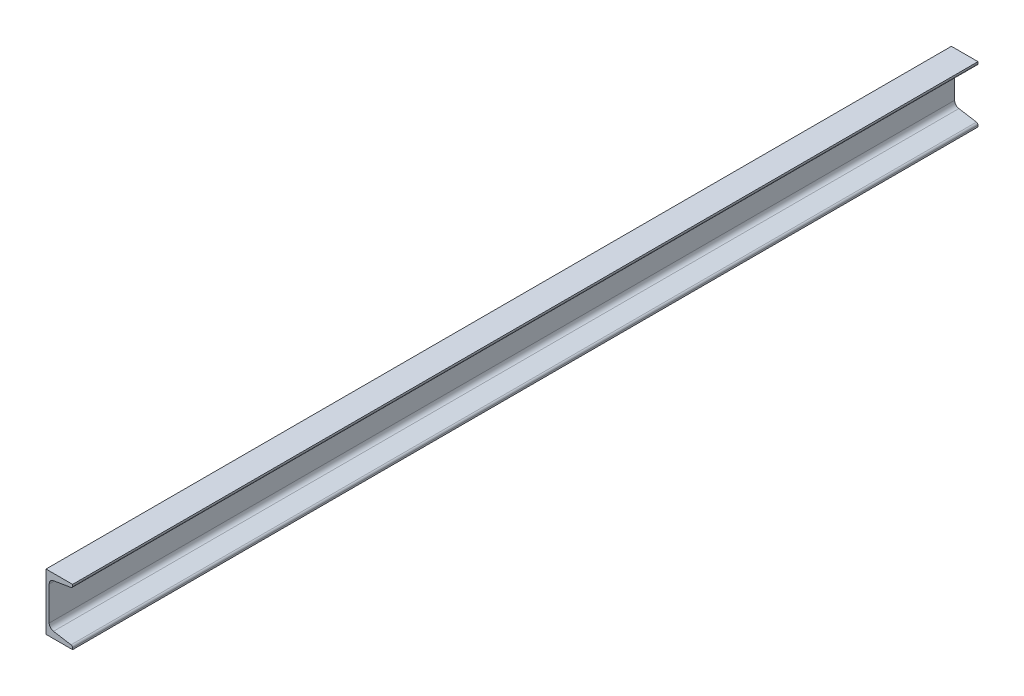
ISO-10303-21;
HEADER;
FILE_DESCRIPTION(('STEP AP214'),'2;1');
FILE_NAME('part.step','',(''),(''),'','','');
FILE_SCHEMA(('AUTOMOTIVE_DESIGN { 1 0 10303 214 1 1 1 1 }'));
ENDSEC;
DATA;
#1=APPLICATION_CONTEXT('core data for automotive mechanical design processes');
#2=APPLICATION_PROTOCOL_DEFINITION('international standard','automotive_design',2000,#1);
#3=PRODUCT_CONTEXT('',#1,'mechanical');
#4=PRODUCT('Part','Part','',(#3));
#5=PRODUCT_RELATED_PRODUCT_CATEGORY('part','',(#4));
#6=PRODUCT_DEFINITION_FORMATION('','',#4);
#7=PRODUCT_DEFINITION_CONTEXT('part definition',#1,'design');
#8=PRODUCT_DEFINITION('design','',#6,#7);
#9=PRODUCT_DEFINITION_SHAPE('','',#8);
#10=(LENGTH_UNIT() NAMED_UNIT(*) SI_UNIT(.MILLI.,.METRE.));
#11=(NAMED_UNIT(*) PLANE_ANGLE_UNIT() SI_UNIT($,.RADIAN.));
#12=(NAMED_UNIT(*) SI_UNIT($,.STERADIAN.) SOLID_ANGLE_UNIT());
#13=UNCERTAINTY_MEASURE_WITH_UNIT(LENGTH_MEASURE(1.E-05),#10,'distance_accuracy_value','');
#14=(GEOMETRIC_REPRESENTATION_CONTEXT(3) GLOBAL_UNCERTAINTY_ASSIGNED_CONTEXT((#13)) GLOBAL_UNIT_ASSIGNED_CONTEXT((#10,
#11,#12)) REPRESENTATION_CONTEXT('',''));
#15=CARTESIAN_POINT('',(0.,0.,0.));
#16=DIRECTION('',(0.,0.,1.));
#17=DIRECTION('',(1.,0.,0.));
#18=AXIS2_PLACEMENT_3D('',#15,#16,#17);
#19=CARTESIAN_POINT('',(0.,0.,609.6));
#20=DIRECTION('',(0.,1.,0.));
#21=DIRECTION('',(-1.,0.,0.));
#22=AXIS2_PLACEMENT_3D('',#19,#20,#21);
#23=PLANE('',#22);
#24=DIRECTION('',(1.,0.,0.));
#25=VECTOR('',#24,1.);
#26=CARTESIAN_POINT('',(0.,0.,-609.6));
#27=LINE('',#26,#25);
#28=CARTESIAN_POINT('',(0.,0.,-609.6));
#29=VERTEX_POINT('',#28);
#30=CARTESIAN_POINT('',(35.814,0.,-609.6));
#31=VERTEX_POINT('',#30);
#32=EDGE_CURVE('E154',#29,#31,#27,.T.);
#33=ORIENTED_EDGE('',*,*,#32,.T.);
#34=DIRECTION('',(0.,0.,-1.));
#35=VECTOR('',#34,1.);
#36=CARTESIAN_POINT('',(35.814,0.,609.6));
#37=LINE('',#36,#35);
#38=CARTESIAN_POINT('',(35.814,0.,609.6));
#39=VERTEX_POINT('',#38);
#40=EDGE_CURVE('E11',#39,#31,#37,.T.);
#41=ORIENTED_EDGE('',*,*,#40,.F.);
#42=DIRECTION('',(1.,0.,0.));
#43=VECTOR('',#42,1.);
#44=CARTESIAN_POINT('',(0.,0.,609.6));
#45=LINE('',#44,#43);
#46=CARTESIAN_POINT('',(0.,0.,609.6));
#47=VERTEX_POINT('',#46);
#48=EDGE_CURVE('E184',#47,#39,#45,.T.);
#49=ORIENTED_EDGE('',*,*,#48,.F.);
#50=DIRECTION('',(0.,0.,-1.));
#51=VECTOR('',#50,1.);
#52=CARTESIAN_POINT('',(0.,0.,609.6));
#53=LINE('',#52,#51);
#54=EDGE_CURVE('E50',#47,#29,#53,.T.);
#55=ORIENTED_EDGE('',*,*,#54,.T.);
#56=EDGE_LOOP('',(#33,#41,#49,#55));
#57=FACE_BOUND('',#56,.T.);
#58=ADVANCED_FACE('F34',(#57),#23,.F.);
#59=CARTESIAN_POINT('',(35.814,0.,609.6));
#60=DIRECTION('',(-1.,0.,0.));
#61=DIRECTION('',(0.,0.,1.));
#62=AXIS2_PLACEMENT_3D('',#59,#60,#61);
#63=PLANE('',#62);
#64=DIRECTION('',(0.,1.,0.));
#65=VECTOR('',#64,1.);
#66=CARTESIAN_POINT('',(35.814,0.,-609.6));
#67=LINE('',#66,#65);
#68=CARTESIAN_POINT('',(35.814,2.15766486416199,-609.6));
#69=VERTEX_POINT('',#68);
#70=EDGE_CURVE('E156',#31,#69,#67,.T.);
#71=ORIENTED_EDGE('',*,*,#70,.T.);
#72=DIRECTION('',(0.,0.,-1.));
#73=VECTOR('',#72,1.);
#74=CARTESIAN_POINT('',(35.814,2.15766486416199,609.6));
#75=LINE('',#74,#73);
#76=CARTESIAN_POINT('',(35.814,2.15766486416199,609.6));
#77=VERTEX_POINT('',#76);
#78=EDGE_CURVE('E42',#77,#69,#75,.T.);
#79=ORIENTED_EDGE('',*,*,#78,.F.);
#80=DIRECTION('',(0.,1.,0.));
#81=VECTOR('',#80,1.);
#82=CARTESIAN_POINT('',(35.814,0.,609.6));
#83=LINE('',#82,#81);
#84=EDGE_CURVE('E100',#39,#77,#83,.T.);
#85=ORIENTED_EDGE('',*,*,#84,.F.);
#86=ORIENTED_EDGE('',*,*,#40,.T.);
#87=EDGE_LOOP('',(#71,#79,#85,#86));
#88=FACE_BOUND('',#87,.T.);
#89=ADVANCED_FACE('F246',(#88),#63,.F.);
#90=CARTESIAN_POINT('',(33.274,2.15766486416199,609.6));
#91=DIRECTION('',(0.,0.,-1.));
#92=DIRECTION('',(-1.,0.,0.));
#93=AXIS2_PLACEMENT_3D('',#90,#91,#92);
#94=CYLINDRICAL_SURFACE('',#93,2.54);
#95=CARTESIAN_POINT('',(33.274,2.15766486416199,-609.6));
#96=DIRECTION('',(0.,0.,1.));
#97=DIRECTION('',(1.,0.,0.));
#98=AXIS2_PLACEMENT_3D('',#95,#96,#97);
#99=CIRCLE('',#98,2.54);
#100=CARTESIAN_POINT('',(33.6916030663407,4.66310049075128,-609.6));
#101=VERTEX_POINT('',#100);
#102=EDGE_CURVE('E158',#69,#101,#99,.T.);
#103=ORIENTED_EDGE('',*,*,#102,.T.);
#104=DIRECTION('',(0.,0.,-1.));
#105=VECTOR('',#104,1.);
#106=CARTESIAN_POINT('',(33.6916030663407,4.66310049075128,609.6));
#107=LINE('',#106,#105);
#108=CARTESIAN_POINT('',(33.6916030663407,4.66310049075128,609.6));
#109=VERTEX_POINT('',#108);
#110=EDGE_CURVE('E199',#109,#101,#107,.T.);
#111=ORIENTED_EDGE('',*,*,#110,.F.);
#112=CARTESIAN_POINT('',(33.274,2.15766486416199,609.6));
#113=DIRECTION('',(0.,0.,1.));
#114=DIRECTION('',(1.,0.,0.));
#115=AXIS2_PLACEMENT_3D('',#112,#113,#114);
#116=CIRCLE('',#115,2.54);
#117=EDGE_CURVE('E206',#77,#109,#116,.T.);
#118=ORIENTED_EDGE('',*,*,#117,.F.);
#119=ORIENTED_EDGE('',*,*,#78,.T.);
#120=EDGE_LOOP('',(#103,#111,#118,#119));
#121=FACE_BOUND('',#120,.T.);
#122=ADVANCED_FACE('F204',(#121),#94,.T.);
#123=CARTESIAN_POINT('',(10.0484717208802,8.60390984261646,609.6));
#124=DIRECTION('',(0.16441065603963,0.986391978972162,0.));
#125=DIRECTION('',(-0.986391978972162,0.16441065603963,0.));
#126=AXIS2_PLACEMENT_3D('',#123,#124,#125);
#127=PLANE('',#126);
#128=DIRECTION('',(0.986391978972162,-0.16441065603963,0.));
#129=VECTOR('',#128,1.);
#130=CARTESIAN_POINT('',(10.0484717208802,8.60390984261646,-609.6));
#131=LINE('',#130,#129);
#132=CARTESIAN_POINT('',(10.0484717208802,8.60390984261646,-609.6));
#133=VERTEX_POINT('',#132);
#134=EDGE_CURVE('E161',#133,#101,#131,.T.);
#135=ORIENTED_EDGE('',*,*,#134,.F.);
#136=DIRECTION('',(0.,0.,-1.));
#137=VECTOR('',#136,1.);
#138=CARTESIAN_POINT('',(10.0484717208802,8.60390984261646,609.6));
#139=LINE('',#138,#137);
#140=CARTESIAN_POINT('',(10.0484717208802,8.60390984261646,609.6));
#141=VERTEX_POINT('',#140);
#142=EDGE_CURVE('E197',#141,#133,#139,.T.);
#143=ORIENTED_EDGE('',*,*,#142,.F.);
#144=DIRECTION('',(0.986391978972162,-0.16441065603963,0.));
#145=VECTOR('',#144,1.);
#146=CARTESIAN_POINT('',(10.0484717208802,8.60390984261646,609.6));
#147=LINE('',#146,#145);
#148=EDGE_CURVE('E215',#141,#109,#147,.T.);
#149=ORIENTED_EDGE('',*,*,#148,.T.);
#150=ORIENTED_EDGE('',*,*,#110,.T.);
#151=EDGE_LOOP('',(#135,#143,#149,#150));
#152=FACE_BOUND('',#151,.T.);
#153=ADVANCED_FACE('F212',(#152),#127,.T.);
#154=CARTESIAN_POINT('',(11.176,15.3685860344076,609.6));
#155=DIRECTION('',(0.,0.,-1.));
#156=DIRECTION('',(-1.,0.,0.));
#157=AXIS2_PLACEMENT_3D('',#154,#155,#156);
#158=CYLINDRICAL_SURFACE('',#157,6.858);
#159=CARTESIAN_POINT('',(11.176,15.3685860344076,-609.6));
#160=DIRECTION('',(0.,0.,1.));
#161=DIRECTION('',(1.,0.,0.));
#162=AXIS2_PLACEMENT_3D('',#159,#160,#161);
#163=CIRCLE('',#162,6.858);
#164=CARTESIAN_POINT('',(4.318,15.3685860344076,-609.6));
#165=VERTEX_POINT('',#164);
#166=EDGE_CURVE('E164',#165,#133,#163,.T.);
#167=ORIENTED_EDGE('',*,*,#166,.F.);
#168=DIRECTION('',(0.,0.,-1.));
#169=VECTOR('',#168,1.);
#170=CARTESIAN_POINT('',(4.318,15.3685860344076,609.6));
#171=LINE('',#170,#169);
#172=CARTESIAN_POINT('',(4.318,15.3685860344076,609.6));
#173=VERTEX_POINT('',#172);
#174=EDGE_CURVE('E195',#173,#165,#171,.T.);
#175=ORIENTED_EDGE('',*,*,#174,.F.);
#176=CARTESIAN_POINT('',(11.176,15.3685860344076,609.6));
#177=DIRECTION('',(0.,0.,1.));
#178=DIRECTION('',(1.,0.,0.));
#179=AXIS2_PLACEMENT_3D('',#176,#177,#178);
#180=CIRCLE('',#179,6.858);
#181=EDGE_CURVE('E218',#173,#141,#180,.T.);
#182=ORIENTED_EDGE('',*,*,#181,.T.);
#183=ORIENTED_EDGE('',*,*,#142,.T.);
#184=EDGE_LOOP('',(#167,#175,#182,#183));
#185=FACE_BOUND('',#184,.T.);
#186=ADVANCED_FACE('F259',(#185),#158,.F.);
#187=CARTESIAN_POINT('',(4.31800000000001,60.8314139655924,609.6));
#188=DIRECTION('',(1.,0.,0.));
#189=DIRECTION('',(0.,1.,0.));
#190=AXIS2_PLACEMENT_3D('',#187,#188,#189);
#191=PLANE('',#190);
#192=DIRECTION('',(0.,-1.,0.));
#193=VECTOR('',#192,1.);
#194=CARTESIAN_POINT('',(4.31800000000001,60.8314139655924,-609.6));
#195=LINE('',#194,#193);
#196=CARTESIAN_POINT('',(4.31800000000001,60.8314139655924,-609.6));
#197=VERTEX_POINT('',#196);
#198=EDGE_CURVE('E167',#197,#165,#195,.T.);
#199=ORIENTED_EDGE('',*,*,#198,.F.);
#200=DIRECTION('',(0.,0.,-1.));
#201=VECTOR('',#200,1.);
#202=CARTESIAN_POINT('',(4.31800000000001,60.8314139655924,609.6));
#203=LINE('',#202,#201);
#204=CARTESIAN_POINT('',(4.31800000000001,60.8314139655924,609.6));
#205=VERTEX_POINT('',#204);
#206=EDGE_CURVE('E193',#205,#197,#203,.T.);
#207=ORIENTED_EDGE('',*,*,#206,.F.);
#208=DIRECTION('',(0.,-1.,0.));
#209=VECTOR('',#208,1.);
#210=CARTESIAN_POINT('',(4.31800000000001,60.8314139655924,609.6));
#211=LINE('',#210,#209);
#212=EDGE_CURVE('E220',#205,#173,#211,.T.);
#213=ORIENTED_EDGE('',*,*,#212,.T.);
#214=ORIENTED_EDGE('',*,*,#174,.T.);
#215=EDGE_LOOP('',(#199,#207,#213,#214));
#216=FACE_BOUND('',#215,.T.);
#217=ADVANCED_FACE('F262',(#216),#191,.T.);
#218=CARTESIAN_POINT('',(11.176,60.8314139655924,609.6));
#219=DIRECTION('',(0.,0.,-1.));
#220=DIRECTION('',(-1.,0.,0.));
#221=AXIS2_PLACEMENT_3D('',#218,#219,#220);
#222=CYLINDRICAL_SURFACE('',#221,6.858);
#223=CARTESIAN_POINT('',(11.176,60.8314139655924,-609.6));
#224=DIRECTION('',(0.,0.,-1.));
#225=DIRECTION('',(-1.,0.,0.));
#226=AXIS2_PLACEMENT_3D('',#223,#224,#225);
#227=CIRCLE('',#226,6.858);
#228=CARTESIAN_POINT('',(10.0484717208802,67.5960901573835,-609.6));
#229=VERTEX_POINT('',#228);
#230=EDGE_CURVE('E170',#197,#229,#227,.T.);
#231=ORIENTED_EDGE('',*,*,#230,.T.);
#232=DIRECTION('',(0.,0.,-1.));
#233=VECTOR('',#232,1.);
#234=CARTESIAN_POINT('',(10.0484717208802,67.5960901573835,609.6));
#235=LINE('',#234,#233);
#236=CARTESIAN_POINT('',(10.0484717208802,67.5960901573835,609.6));
#237=VERTEX_POINT('',#236);
#238=EDGE_CURVE('E190',#237,#229,#235,.T.);
#239=ORIENTED_EDGE('',*,*,#238,.F.);
#240=CARTESIAN_POINT('',(11.176,60.8314139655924,609.6));
#241=DIRECTION('',(0.,0.,-1.));
#242=DIRECTION('',(-1.,0.,0.));
#243=AXIS2_PLACEMENT_3D('',#240,#241,#242);
#244=CIRCLE('',#243,6.858);
#245=EDGE_CURVE('E227',#205,#237,#244,.T.);
#246=ORIENTED_EDGE('',*,*,#245,.F.);
#247=ORIENTED_EDGE('',*,*,#206,.T.);
#248=EDGE_LOOP('',(#231,#239,#246,#247));
#249=FACE_BOUND('',#248,.T.);
#250=ADVANCED_FACE('F266',(#249),#222,.F.);
#251=CARTESIAN_POINT('',(10.0484717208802,67.5960901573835,609.6));
#252=DIRECTION('',(-0.164410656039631,0.986391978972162,0.));
#253=DIRECTION('',(-0.986391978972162,-0.164410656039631,0.));
#254=AXIS2_PLACEMENT_3D('',#251,#252,#253);
#255=PLANE('',#254);
#256=DIRECTION('',(0.986391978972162,0.164410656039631,0.));
#257=VECTOR('',#256,1.);
#258=CARTESIAN_POINT('',(10.0484717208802,67.5960901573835,-609.6));
#259=LINE('',#258,#257);
#260=CARTESIAN_POINT('',(33.6916030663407,71.5368995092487,-609.6));
#261=VERTEX_POINT('',#260);
#262=EDGE_CURVE('E172',#229,#261,#259,.T.);
#263=ORIENTED_EDGE('',*,*,#262,.T.);
#264=DIRECTION('',(0.,0.,-1.));
#265=VECTOR('',#264,1.);
#266=CARTESIAN_POINT('',(33.6916030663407,71.5368995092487,609.6));
#267=LINE('',#266,#265);
#268=CARTESIAN_POINT('',(33.6916030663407,71.5368995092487,609.6));
#269=VERTEX_POINT('',#268);
#270=EDGE_CURVE('E188',#269,#261,#267,.T.);
#271=ORIENTED_EDGE('',*,*,#270,.F.);
#272=DIRECTION('',(0.986391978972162,0.164410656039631,0.));
#273=VECTOR('',#272,1.);
#274=CARTESIAN_POINT('',(10.0484717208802,67.5960901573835,609.6));
#275=LINE('',#274,#273);
#276=EDGE_CURVE('E229',#237,#269,#275,.T.);
#277=ORIENTED_EDGE('',*,*,#276,.F.);
#278=ORIENTED_EDGE('',*,*,#238,.T.);
#279=EDGE_LOOP('',(#263,#271,#277,#278));
#280=FACE_BOUND('',#279,.T.);
#281=ADVANCED_FACE('F270',(#280),#255,.F.);
#282=CARTESIAN_POINT('',(33.274,74.042335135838,609.6));
#283=DIRECTION('',(0.,0.,-1.));
#284=DIRECTION('',(-1.,0.,0.));
#285=AXIS2_PLACEMENT_3D('',#282,#283,#284);
#286=CYLINDRICAL_SURFACE('',#285,2.53999999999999);
#287=CARTESIAN_POINT('',(33.274,74.042335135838,-609.6));
#288=DIRECTION('',(0.,0.,-1.));
#289=DIRECTION('',(-1.,0.,0.));
#290=AXIS2_PLACEMENT_3D('',#287,#288,#289);
#291=CIRCLE('',#290,2.53999999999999);
#292=CARTESIAN_POINT('',(35.814,74.042335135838,-609.6));
#293=VERTEX_POINT('',#292);
#294=EDGE_CURVE('E175',#293,#261,#291,.T.);
#295=ORIENTED_EDGE('',*,*,#294,.F.);
#296=DIRECTION('',(0.,0.,-1.));
#297=VECTOR('',#296,1.);
#298=CARTESIAN_POINT('',(35.814,74.042335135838,609.6));
#299=LINE('',#298,#297);
#300=CARTESIAN_POINT('',(35.814,74.042335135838,609.6));
#301=VERTEX_POINT('',#300);
#302=EDGE_CURVE('E137',#301,#293,#299,.T.);
#303=ORIENTED_EDGE('',*,*,#302,.F.);
#304=CARTESIAN_POINT('',(33.274,74.042335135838,609.6));
#305=DIRECTION('',(0.,0.,-1.));
#306=DIRECTION('',(-1.,0.,0.));
#307=AXIS2_PLACEMENT_3D('',#304,#305,#306);
#308=CIRCLE('',#307,2.53999999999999);
#309=EDGE_CURVE('E146',#301,#269,#308,.T.);
#310=ORIENTED_EDGE('',*,*,#309,.T.);
#311=ORIENTED_EDGE('',*,*,#270,.T.);
#312=EDGE_LOOP('',(#295,#303,#310,#311));
#313=FACE_BOUND('',#312,.T.);
#314=ADVANCED_FACE('F232',(#313),#286,.T.);
#315=CARTESIAN_POINT('',(35.814,76.2,609.6));
#316=DIRECTION('',(1.,0.,0.));
#317=DIRECTION('',(0.,1.,0.));
#318=AXIS2_PLACEMENT_3D('',#315,#316,#317);
#319=PLANE('',#318);
#320=DIRECTION('',(0.,-1.,0.));
#321=VECTOR('',#320,1.);
#322=CARTESIAN_POINT('',(35.814,76.2,-609.6));
#323=LINE('',#322,#321);
#324=CARTESIAN_POINT('',(35.814,76.2,-609.6));
#325=VERTEX_POINT('',#324);
#326=EDGE_CURVE('E133',#325,#293,#323,.T.);
#327=ORIENTED_EDGE('',*,*,#326,.F.);
#328=DIRECTION('',(0.,0.,-1.));
#329=VECTOR('',#328,1.);
#330=CARTESIAN_POINT('',(35.814,76.2,609.6));
#331=LINE('',#330,#329);
#332=CARTESIAN_POINT('',(35.814,76.2,609.6));
#333=VERTEX_POINT('',#332);
#334=EDGE_CURVE('E128',#333,#325,#331,.T.);
#335=ORIENTED_EDGE('',*,*,#334,.F.);
#336=DIRECTION('',(0.,-1.,0.));
#337=VECTOR('',#336,1.);
#338=CARTESIAN_POINT('',(35.814,76.2,609.6));
#339=LINE('',#338,#337);
#340=EDGE_CURVE('E131',#333,#301,#339,.T.);
#341=ORIENTED_EDGE('',*,*,#340,.T.);
#342=ORIENTED_EDGE('',*,*,#302,.T.);
#343=EDGE_LOOP('',(#327,#335,#341,#342));
#344=FACE_BOUND('',#343,.T.);
#345=ADVANCED_FACE('F130',(#344),#319,.T.);
#346=CARTESIAN_POINT('',(0.,76.2,609.6));
#347=DIRECTION('',(0.,1.,0.));
#348=DIRECTION('',(0.,0.,1.));
#349=AXIS2_PLACEMENT_3D('',#346,#347,#348);
#350=PLANE('',#349);
#351=DIRECTION('',(1.,0.,0.));
#352=VECTOR('',#351,1.);
#353=CARTESIAN_POINT('',(0.,76.2,-609.6));
#354=LINE('',#353,#352);
#355=CARTESIAN_POINT('',(0.,76.2,-609.6));
#356=VERTEX_POINT('',#355);
#357=EDGE_CURVE('E179',#356,#325,#354,.T.);
#358=ORIENTED_EDGE('',*,*,#357,.F.);
#359=DIRECTION('',(0.,0.,-1.));
#360=VECTOR('',#359,1.);
#361=CARTESIAN_POINT('',(0.,76.2,609.6));
#362=LINE('',#361,#360);
#363=CARTESIAN_POINT('',(0.,76.2,609.6));
#364=VERTEX_POINT('',#363);
#365=EDGE_CURVE('E88',#364,#356,#362,.T.);
#366=ORIENTED_EDGE('',*,*,#365,.F.);
#367=DIRECTION('',(1.,0.,0.));
#368=VECTOR('',#367,1.);
#369=CARTESIAN_POINT('',(0.,76.2,609.6));
#370=LINE('',#369,#368);
#371=EDGE_CURVE('E144',#364,#333,#370,.T.);
#372=ORIENTED_EDGE('',*,*,#371,.T.);
#373=ORIENTED_EDGE('',*,*,#334,.T.);
#374=EDGE_LOOP('',(#358,#366,#372,#373));
#375=FACE_BOUND('',#374,.T.);
#376=ADVANCED_FACE('F148',(#375),#350,.T.);
#377=CARTESIAN_POINT('',(0.,0.,609.6));
#378=DIRECTION('',(-1.,0.,0.));
#379=DIRECTION('',(0.,-1.,0.));
#380=AXIS2_PLACEMENT_3D('',#377,#378,#379);
#381=PLANE('',#380);
#382=DIRECTION('',(0.,1.,0.));
#383=VECTOR('',#382,1.);
#384=CARTESIAN_POINT('',(0.,0.,-609.6));
#385=LINE('',#384,#383);
#386=EDGE_CURVE('E181',#29,#356,#385,.T.);
#387=ORIENTED_EDGE('',*,*,#386,.F.);
#388=ORIENTED_EDGE('',*,*,#54,.F.);
#389=DIRECTION('',(0.,1.,0.));
#390=VECTOR('',#389,1.);
#391=CARTESIAN_POINT('',(0.,0.,609.6));
#392=LINE('',#391,#390);
#393=EDGE_CURVE('E149',#47,#364,#392,.T.);
#394=ORIENTED_EDGE('',*,*,#393,.T.);
#395=ORIENTED_EDGE('',*,*,#365,.T.);
#396=EDGE_LOOP('',(#387,#388,#394,#395));
#397=FACE_BOUND('',#396,.T.);
#398=ADVANCED_FACE('F235',(#397),#381,.T.);
#399=CARTESIAN_POINT('',(33.274,2.15766486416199,609.6));
#400=DIRECTION('',(0.,0.,1.));
#401=DIRECTION('',(1.,0.,0.));
#402=AXIS2_PLACEMENT_3D('',#399,#400,#401);
#403=PLANE('',#402);
#404=ORIENTED_EDGE('',*,*,#48,.T.);
#405=ORIENTED_EDGE('',*,*,#84,.T.);
#406=ORIENTED_EDGE('',*,*,#117,.T.);
#407=ORIENTED_EDGE('',*,*,#148,.F.);
#408=ORIENTED_EDGE('',*,*,#181,.F.);
#409=ORIENTED_EDGE('',*,*,#212,.F.);
#410=ORIENTED_EDGE('',*,*,#245,.T.);
#411=ORIENTED_EDGE('',*,*,#276,.T.);
#412=ORIENTED_EDGE('',*,*,#309,.F.);
#413=ORIENTED_EDGE('',*,*,#340,.F.);
#414=ORIENTED_EDGE('',*,*,#371,.F.);
#415=ORIENTED_EDGE('',*,*,#393,.F.);
#416=EDGE_LOOP('',(#404,#405,#406,#407,#408,#409,#410,#411,#412,#413,#414,#415));
#417=FACE_BOUND('',#416,.T.);
#418=ADVANCED_FACE('F142',(#417),#403,.T.);
#419=CARTESIAN_POINT('',(33.274,2.15766486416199,-609.6));
#420=DIRECTION('',(0.,0.,1.));
#421=DIRECTION('',(1.,0.,0.));
#422=AXIS2_PLACEMENT_3D('',#419,#420,#421);
#423=PLANE('',#422);
#424=ORIENTED_EDGE('',*,*,#32,.F.);
#425=ORIENTED_EDGE('',*,*,#386,.T.);
#426=ORIENTED_EDGE('',*,*,#357,.T.);
#427=ORIENTED_EDGE('',*,*,#326,.T.);
#428=ORIENTED_EDGE('',*,*,#294,.T.);
#429=ORIENTED_EDGE('',*,*,#262,.F.);
#430=ORIENTED_EDGE('',*,*,#230,.F.);
#431=ORIENTED_EDGE('',*,*,#198,.T.);
#432=ORIENTED_EDGE('',*,*,#166,.T.);
#433=ORIENTED_EDGE('',*,*,#134,.T.);
#434=ORIENTED_EDGE('',*,*,#102,.F.);
#435=ORIENTED_EDGE('',*,*,#70,.F.);
#436=EDGE_LOOP('',(#424,#425,#426,#427,#428,#429,#430,#431,#432,#433,#434,#435));
#437=FACE_BOUND('',#436,.T.);
#438=ADVANCED_FACE('F208',(#437),#423,.F.);
#439=CLOSED_SHELL('',(#58,#89,#122,#153,#186,#217,#250,#281,#314,#345,#376,#398,#418,#438));
#440=MANIFOLD_SOLID_BREP('B2',#439);
#441=ADVANCED_BREP_SHAPE_REPRESENTATION('',(#18,#440),#14);
#442=SHAPE_DEFINITION_REPRESENTATION(#9,#441);
ENDSEC;
END-ISO-10303-21;
